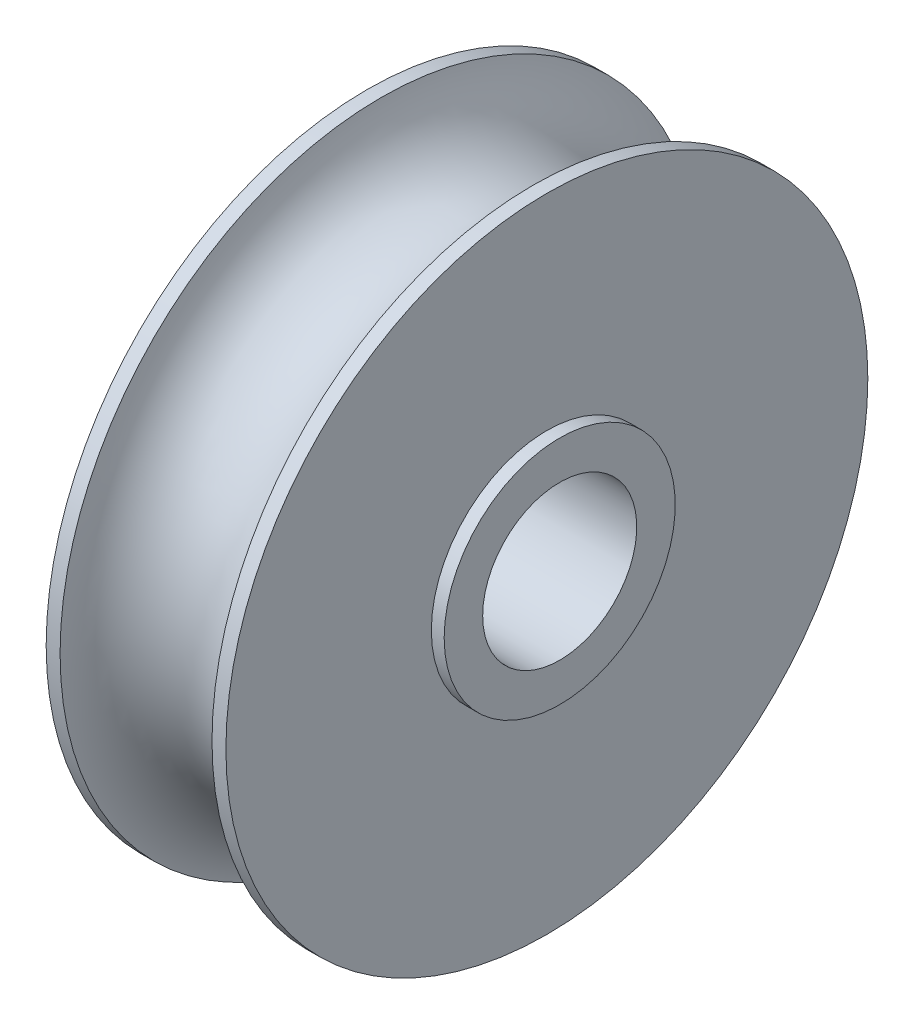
from build123d import *


with BuildPart() as part:
    # Esquisse1 → R_volution1 (revolve)
    with BuildSketch(Plane.XY, mode=Mode.PRIVATE) as r_volution1_sk:
        with BuildLine():
            Line((2.958039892, 12.5), (3.5, 12.5))
            Line((3.5, 12.5), (3.5, 4.5))
            Line((3.5, 4.5), (4, 4.5))
            Line((4, 4.5), (4, 3))
            Line((4, 3), (-4, 3))
            Line((-4, 3), (-4, 4.5))
            Line((-4, 4.5), (-3.5, 4.5))
            Line((-3.5, 4.5), (-3.5, 12.5))
            Line((-3.5, 12.5), (-2.958039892, 12.5))
            ThreePointArc((-2.958039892, 12.5), (0, 10), (2.958039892, 12.5))
        make_face()
    revolve(r_volution1_sk.sketch.rotate(Axis((-29.079829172, 0, 0), (1, 0, 0)), 90), axis=Axis((-29.079829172, 0, 0), (1, 0, 0)))


solid = part.part
